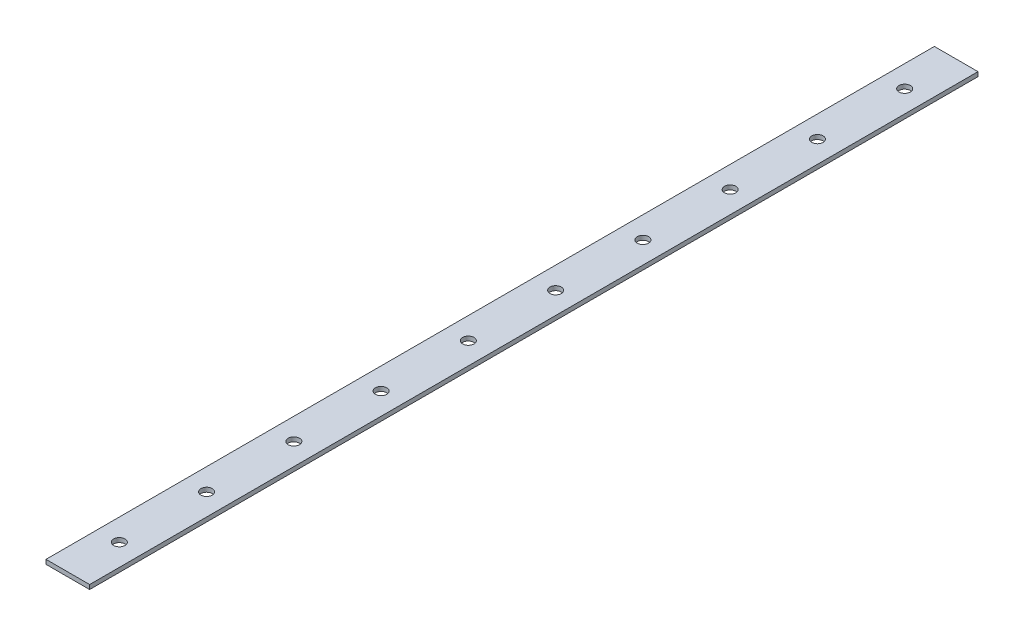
ISO-10303-21;
HEADER;
FILE_DESCRIPTION(('STEP AP214'),'2;1');
FILE_NAME('part.step','',(''),(''),'','','');
FILE_SCHEMA(('AUTOMOTIVE_DESIGN { 1 0 10303 214 1 1 1 1 }'));
ENDSEC;
DATA;
#1=APPLICATION_CONTEXT('core data for automotive mechanical design processes');
#2=APPLICATION_PROTOCOL_DEFINITION('international standard','automotive_design',2000,#1);
#3=PRODUCT_CONTEXT('',#1,'mechanical');
#4=PRODUCT('Part','Part','',(#3));
#5=PRODUCT_RELATED_PRODUCT_CATEGORY('part','',(#4));
#6=PRODUCT_DEFINITION_FORMATION('','',#4);
#7=PRODUCT_DEFINITION_CONTEXT('part definition',#1,'design');
#8=PRODUCT_DEFINITION('design','',#6,#7);
#9=PRODUCT_DEFINITION_SHAPE('','',#8);
#10=(LENGTH_UNIT() NAMED_UNIT(*) SI_UNIT(.MILLI.,.METRE.));
#11=(NAMED_UNIT(*) PLANE_ANGLE_UNIT() SI_UNIT($,.RADIAN.));
#12=(NAMED_UNIT(*) SI_UNIT($,.STERADIAN.) SOLID_ANGLE_UNIT());
#13=UNCERTAINTY_MEASURE_WITH_UNIT(LENGTH_MEASURE(1.E-05),#10,'distance_accuracy_value','');
#14=(GEOMETRIC_REPRESENTATION_CONTEXT(3) GLOBAL_UNCERTAINTY_ASSIGNED_CONTEXT((#13)) GLOBAL_UNIT_ASSIGNED_CONTEXT((#10,
#11,#12)) REPRESENTATION_CONTEXT('',''));
#15=CARTESIAN_POINT('',(0.,0.,0.));
#16=DIRECTION('',(0.,0.,1.));
#17=DIRECTION('',(1.,0.,0.));
#18=AXIS2_PLACEMENT_3D('',#15,#16,#17);
#19=CARTESIAN_POINT('',(-25.,2.5,509.));
#20=DIRECTION('',(1.,0.,0.));
#21=DIRECTION('',(0.,0.,-1.));
#22=AXIS2_PLACEMENT_3D('',#19,#20,#21);
#23=PLANE('',#22);
#24=DIRECTION('',(0.,-1.,0.));
#25=VECTOR('',#24,1.);
#26=CARTESIAN_POINT('',(-25.,2.5,-509.));
#27=LINE('',#26,#25);
#28=CARTESIAN_POINT('',(-25.,2.5,-509.));
#29=VERTEX_POINT('',#28);
#30=CARTESIAN_POINT('',(-25.,-2.5,-509.));
#31=VERTEX_POINT('',#30);
#32=EDGE_CURVE('E74',#29,#31,#27,.T.);
#33=ORIENTED_EDGE('',*,*,#32,.T.);
#34=DIRECTION('',(0.,0.,-1.));
#35=VECTOR('',#34,1.);
#36=CARTESIAN_POINT('',(-25.,-2.5,509.));
#37=LINE('',#36,#35);
#38=CARTESIAN_POINT('',(-25.,-2.5,509.));
#39=VERTEX_POINT('',#38);
#40=EDGE_CURVE('E11',#39,#31,#37,.T.);
#41=ORIENTED_EDGE('',*,*,#40,.F.);
#42=DIRECTION('',(0.,-1.,0.));
#43=VECTOR('',#42,1.);
#44=CARTESIAN_POINT('',(-25.,2.5,509.));
#45=LINE('',#44,#43);
#46=CARTESIAN_POINT('',(-25.,2.5,509.));
#47=VERTEX_POINT('',#46);
#48=EDGE_CURVE('E97',#47,#39,#45,.T.);
#49=ORIENTED_EDGE('',*,*,#48,.F.);
#50=DIRECTION('',(0.,0.,-1.));
#51=VECTOR('',#50,1.);
#52=CARTESIAN_POINT('',(-25.,2.5,509.));
#53=LINE('',#52,#51);
#54=EDGE_CURVE('E86',#47,#29,#53,.T.);
#55=ORIENTED_EDGE('',*,*,#54,.T.);
#56=EDGE_LOOP('',(#33,#41,#49,#55));
#57=FACE_BOUND('',#56,.T.);
#58=ADVANCED_FACE('F30',(#57),#23,.F.);
#59=CARTESIAN_POINT('',(-25.,-2.5,509.));
#60=DIRECTION('',(0.,1.,0.));
#61=DIRECTION('',(-1.,0.,0.));
#62=AXIS2_PLACEMENT_3D('',#59,#60,#61);
#63=PLANE('',#62);
#64=CARTESIAN_POINT('',(3.14233502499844E-12,-2.5,450.));
#65=DIRECTION('',(0.,1.,0.));
#66=DIRECTION('',(0.,0.,1.));
#67=AXIS2_PLACEMENT_3D('',#64,#65,#66);
#68=CIRCLE('',#67,6.50000000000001);
#69=CARTESIAN_POINT('',(3.14233502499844E-12,-2.5,456.5));
#70=VERTEX_POINT('',#69);
#71=EDGE_CURVE('E132',#70,#70,#68,.T.);
#72=ORIENTED_EDGE('',*,*,#71,.T.);
#73=EDGE_LOOP('',(#72));
#74=FACE_BOUND('',#73,.T.);
#75=CARTESIAN_POINT('',(2.79318668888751E-12,-2.5,350.));
#76=DIRECTION('',(0.,1.,0.));
#77=DIRECTION('',(0.,0.,1.));
#78=AXIS2_PLACEMENT_3D('',#75,#76,#77);
#79=CIRCLE('',#78,6.50000000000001);
#80=CARTESIAN_POINT('',(2.79318668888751E-12,-2.5,356.5));
#81=VERTEX_POINT('',#80);
#82=EDGE_CURVE('E136',#81,#81,#79,.T.);
#83=ORIENTED_EDGE('',*,*,#82,.T.);
#84=EDGE_LOOP('',(#83));
#85=FACE_BOUND('',#84,.T.);
#86=CARTESIAN_POINT('',(2.44403835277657E-12,-2.5,250.));
#87=DIRECTION('',(0.,1.,0.));
#88=DIRECTION('',(0.,0.,1.));
#89=AXIS2_PLACEMENT_3D('',#86,#87,#88);
#90=CIRCLE('',#89,6.50000000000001);
#91=CARTESIAN_POINT('',(2.44403835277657E-12,-2.5,256.5));
#92=VERTEX_POINT('',#91);
#93=EDGE_CURVE('E140',#92,#92,#90,.T.);
#94=ORIENTED_EDGE('',*,*,#93,.T.);
#95=EDGE_LOOP('',(#94));
#96=FACE_BOUND('',#95,.T.);
#97=CARTESIAN_POINT('',(2.09489001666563E-12,-2.5,150.));
#98=DIRECTION('',(0.,1.,0.));
#99=DIRECTION('',(0.,0.,1.));
#100=AXIS2_PLACEMENT_3D('',#97,#98,#99);
#101=CIRCLE('',#100,6.50000000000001);
#102=CARTESIAN_POINT('',(2.09489001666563E-12,-2.5,156.5));
#103=VERTEX_POINT('',#102);
#104=EDGE_CURVE('E144',#103,#103,#101,.T.);
#105=ORIENTED_EDGE('',*,*,#104,.T.);
#106=EDGE_LOOP('',(#105));
#107=FACE_BOUND('',#106,.T.);
#108=CARTESIAN_POINT('',(1.74574168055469E-12,-2.5,49.9999999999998));
#109=DIRECTION('',(0.,1.,0.));
#110=DIRECTION('',(0.,0.,1.));
#111=AXIS2_PLACEMENT_3D('',#108,#109,#110);
#112=CIRCLE('',#111,6.5);
#113=CARTESIAN_POINT('',(1.74574168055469E-12,-2.5,56.4999999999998));
#114=VERTEX_POINT('',#113);
#115=EDGE_CURVE('E148',#114,#114,#112,.T.);
#116=ORIENTED_EDGE('',*,*,#115,.T.);
#117=EDGE_LOOP('',(#116));
#118=FACE_BOUND('',#117,.T.);
#119=CARTESIAN_POINT('',(1.39659334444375E-12,-2.5,-50.0000000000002));
#120=DIRECTION('',(0.,1.,0.));
#121=DIRECTION('',(0.,0.,1.));
#122=AXIS2_PLACEMENT_3D('',#119,#120,#121);
#123=CIRCLE('',#122,6.5);
#124=CARTESIAN_POINT('',(1.39659334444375E-12,-2.5,-43.5000000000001));
#125=VERTEX_POINT('',#124);
#126=EDGE_CURVE('E152',#125,#125,#123,.T.);
#127=ORIENTED_EDGE('',*,*,#126,.T.);
#128=EDGE_LOOP('',(#127));
#129=FACE_BOUND('',#128,.T.);
#130=CARTESIAN_POINT('',(1.04744500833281E-12,-2.5,-150.));
#131=DIRECTION('',(0.,1.,0.));
#132=DIRECTION('',(0.,0.,1.));
#133=AXIS2_PLACEMENT_3D('',#130,#131,#132);
#134=CIRCLE('',#133,6.50000000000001);
#135=CARTESIAN_POINT('',(1.04744500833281E-12,-2.5,-143.5));
#136=VERTEX_POINT('',#135);
#137=EDGE_CURVE('E156',#136,#136,#134,.T.);
#138=ORIENTED_EDGE('',*,*,#137,.T.);
#139=EDGE_LOOP('',(#138));
#140=FACE_BOUND('',#139,.T.);
#141=CARTESIAN_POINT('',(6.98296672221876E-13,-2.5,-250.));
#142=DIRECTION('',(0.,1.,0.));
#143=DIRECTION('',(0.,0.,1.));
#144=AXIS2_PLACEMENT_3D('',#141,#142,#143);
#145=CIRCLE('',#144,6.50000000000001);
#146=CARTESIAN_POINT('',(6.98296672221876E-13,-2.5,-243.5));
#147=VERTEX_POINT('',#146);
#148=EDGE_CURVE('E160',#147,#147,#145,.T.);
#149=ORIENTED_EDGE('',*,*,#148,.T.);
#150=EDGE_LOOP('',(#149));
#151=FACE_BOUND('',#150,.T.);
#152=CARTESIAN_POINT('',(3.49148336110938E-13,-2.5,-350.));
#153=DIRECTION('',(0.,1.,0.));
#154=DIRECTION('',(0.,0.,1.));
#155=AXIS2_PLACEMENT_3D('',#152,#153,#154);
#156=CIRCLE('',#155,6.50000000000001);
#157=CARTESIAN_POINT('',(3.49148336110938E-13,-2.5,-343.5));
#158=VERTEX_POINT('',#157);
#159=EDGE_CURVE('E164',#158,#158,#156,.T.);
#160=ORIENTED_EDGE('',*,*,#159,.T.);
#161=EDGE_LOOP('',(#160));
#162=FACE_BOUND('',#161,.T.);
#163=CARTESIAN_POINT('',(0.,-2.5,-450.));
#164=DIRECTION('',(0.,1.,0.));
#165=DIRECTION('',(0.,0.,1.));
#166=AXIS2_PLACEMENT_3D('',#163,#164,#165);
#167=CIRCLE('',#166,6.50000000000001);
#168=CARTESIAN_POINT('',(0.,-2.5,-443.5));
#169=VERTEX_POINT('',#168);
#170=EDGE_CURVE('E87',#169,#169,#167,.T.);
#171=ORIENTED_EDGE('',*,*,#170,.T.);
#172=EDGE_LOOP('',(#171));
#173=FACE_BOUND('',#172,.T.);
#174=DIRECTION('',(1.,0.,0.));
#175=VECTOR('',#174,1.);
#176=CARTESIAN_POINT('',(-25.,-2.5,-509.));
#177=LINE('',#176,#175);
#178=CARTESIAN_POINT('',(25.,-2.5,-509.));
#179=VERTEX_POINT('',#178);
#180=EDGE_CURVE('E70',#31,#179,#177,.T.);
#181=ORIENTED_EDGE('',*,*,#180,.T.);
#182=DIRECTION('',(0.,0.,-1.));
#183=VECTOR('',#182,1.);
#184=CARTESIAN_POINT('',(25.,-2.5,509.));
#185=LINE('',#184,#183);
#186=CARTESIAN_POINT('',(25.,-2.5,509.));
#187=VERTEX_POINT('',#186);
#188=EDGE_CURVE('E37',#187,#179,#185,.T.);
#189=ORIENTED_EDGE('',*,*,#188,.F.);
#190=DIRECTION('',(1.,0.,0.));
#191=VECTOR('',#190,1.);
#192=CARTESIAN_POINT('',(-25.,-2.5,509.));
#193=LINE('',#192,#191);
#194=EDGE_CURVE('E82',#39,#187,#193,.T.);
#195=ORIENTED_EDGE('',*,*,#194,.F.);
#196=ORIENTED_EDGE('',*,*,#40,.T.);
#197=EDGE_LOOP('',(#181,#189,#195,#196));
#198=FACE_BOUND('',#197,.T.);
#199=ADVANCED_FACE('F81',(#74,#85,#96,#107,#118,#129,#140,#151,#162,#173,#198),#63,.F.);
#200=CARTESIAN_POINT('',(25.,2.5,509.));
#201=DIRECTION('',(-1.,0.,0.));
#202=DIRECTION('',(0.,-1.,0.));
#203=AXIS2_PLACEMENT_3D('',#200,#201,#202);
#204=PLANE('',#203);
#205=DIRECTION('',(0.,1.,0.));
#206=VECTOR('',#205,1.);
#207=CARTESIAN_POINT('',(25.,2.5,-509.));
#208=LINE('',#207,#206);
#209=CARTESIAN_POINT('',(25.,2.5,-509.));
#210=VERTEX_POINT('',#209);
#211=EDGE_CURVE('E75',#179,#210,#208,.T.);
#212=ORIENTED_EDGE('',*,*,#211,.T.);
#213=DIRECTION('',(0.,0.,-1.));
#214=VECTOR('',#213,1.);
#215=CARTESIAN_POINT('',(25.,2.5,509.));
#216=LINE('',#215,#214);
#217=CARTESIAN_POINT('',(25.,2.5,509.));
#218=VERTEX_POINT('',#217);
#219=EDGE_CURVE('E103',#218,#210,#216,.T.);
#220=ORIENTED_EDGE('',*,*,#219,.F.);
#221=DIRECTION('',(0.,1.,0.));
#222=VECTOR('',#221,1.);
#223=CARTESIAN_POINT('',(25.,2.5,509.));
#224=LINE('',#223,#222);
#225=EDGE_CURVE('E49',#187,#218,#224,.T.);
#226=ORIENTED_EDGE('',*,*,#225,.F.);
#227=ORIENTED_EDGE('',*,*,#188,.T.);
#228=EDGE_LOOP('',(#212,#220,#226,#227));
#229=FACE_BOUND('',#228,.T.);
#230=ADVANCED_FACE('F106',(#229),#204,.F.);
#231=CARTESIAN_POINT('',(-25.,2.5,509.));
#232=DIRECTION('',(0.,-1.,0.));
#233=DIRECTION('',(0.,0.,-1.));
#234=AXIS2_PLACEMENT_3D('',#231,#232,#233);
#235=PLANE('',#234);
#236=CARTESIAN_POINT('',(3.14233502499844E-12,2.5,450.));
#237=DIRECTION('',(0.,1.,0.));
#238=DIRECTION('',(0.,0.,1.));
#239=AXIS2_PLACEMENT_3D('',#236,#237,#238);
#240=CIRCLE('',#239,6.50000000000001);
#241=CARTESIAN_POINT('',(3.14233502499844E-12,2.5,456.5));
#242=VERTEX_POINT('',#241);
#243=EDGE_CURVE('E208',#242,#242,#240,.T.);
#244=ORIENTED_EDGE('',*,*,#243,.F.);
#245=EDGE_LOOP('',(#244));
#246=FACE_BOUND('',#245,.T.);
#247=CARTESIAN_POINT('',(2.79318668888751E-12,2.5,350.));
#248=DIRECTION('',(0.,1.,0.));
#249=DIRECTION('',(0.,0.,1.));
#250=AXIS2_PLACEMENT_3D('',#247,#248,#249);
#251=CIRCLE('',#250,6.50000000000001);
#252=CARTESIAN_POINT('',(2.79318668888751E-12,2.5,356.5));
#253=VERTEX_POINT('',#252);
#254=EDGE_CURVE('E204',#253,#253,#251,.T.);
#255=ORIENTED_EDGE('',*,*,#254,.F.);
#256=EDGE_LOOP('',(#255));
#257=FACE_BOUND('',#256,.T.);
#258=CARTESIAN_POINT('',(2.44403835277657E-12,2.5,250.));
#259=DIRECTION('',(0.,1.,0.));
#260=DIRECTION('',(0.,0.,1.));
#261=AXIS2_PLACEMENT_3D('',#258,#259,#260);
#262=CIRCLE('',#261,6.50000000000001);
#263=CARTESIAN_POINT('',(2.44403835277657E-12,2.5,256.5));
#264=VERTEX_POINT('',#263);
#265=EDGE_CURVE('E200',#264,#264,#262,.T.);
#266=ORIENTED_EDGE('',*,*,#265,.F.);
#267=EDGE_LOOP('',(#266));
#268=FACE_BOUND('',#267,.T.);
#269=CARTESIAN_POINT('',(2.09489001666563E-12,2.5,150.));
#270=DIRECTION('',(0.,1.,0.));
#271=DIRECTION('',(0.,0.,1.));
#272=AXIS2_PLACEMENT_3D('',#269,#270,#271);
#273=CIRCLE('',#272,6.50000000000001);
#274=CARTESIAN_POINT('',(2.09489001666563E-12,2.5,156.5));
#275=VERTEX_POINT('',#274);
#276=EDGE_CURVE('E196',#275,#275,#273,.T.);
#277=ORIENTED_EDGE('',*,*,#276,.F.);
#278=EDGE_LOOP('',(#277));
#279=FACE_BOUND('',#278,.T.);
#280=CARTESIAN_POINT('',(1.74574168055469E-12,2.5,49.9999999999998));
#281=DIRECTION('',(0.,1.,0.));
#282=DIRECTION('',(0.,0.,1.));
#283=AXIS2_PLACEMENT_3D('',#280,#281,#282);
#284=CIRCLE('',#283,6.5);
#285=CARTESIAN_POINT('',(1.74574168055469E-12,2.5,56.4999999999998));
#286=VERTEX_POINT('',#285);
#287=EDGE_CURVE('E192',#286,#286,#284,.T.);
#288=ORIENTED_EDGE('',*,*,#287,.F.);
#289=EDGE_LOOP('',(#288));
#290=FACE_BOUND('',#289,.T.);
#291=CARTESIAN_POINT('',(1.39659334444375E-12,2.5,-50.0000000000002));
#292=DIRECTION('',(0.,1.,0.));
#293=DIRECTION('',(0.,0.,1.));
#294=AXIS2_PLACEMENT_3D('',#291,#292,#293);
#295=CIRCLE('',#294,6.5);
#296=CARTESIAN_POINT('',(1.39659334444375E-12,2.5,-43.5000000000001));
#297=VERTEX_POINT('',#296);
#298=EDGE_CURVE('E188',#297,#297,#295,.T.);
#299=ORIENTED_EDGE('',*,*,#298,.F.);
#300=EDGE_LOOP('',(#299));
#301=FACE_BOUND('',#300,.T.);
#302=CARTESIAN_POINT('',(1.04744500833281E-12,2.5,-150.));
#303=DIRECTION('',(0.,1.,0.));
#304=DIRECTION('',(0.,0.,1.));
#305=AXIS2_PLACEMENT_3D('',#302,#303,#304);
#306=CIRCLE('',#305,6.50000000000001);
#307=CARTESIAN_POINT('',(1.04744500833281E-12,2.5,-143.5));
#308=VERTEX_POINT('',#307);
#309=EDGE_CURVE('E184',#308,#308,#306,.T.);
#310=ORIENTED_EDGE('',*,*,#309,.F.);
#311=EDGE_LOOP('',(#310));
#312=FACE_BOUND('',#311,.T.);
#313=CARTESIAN_POINT('',(6.98296672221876E-13,2.5,-250.));
#314=DIRECTION('',(0.,1.,0.));
#315=DIRECTION('',(0.,0.,1.));
#316=AXIS2_PLACEMENT_3D('',#313,#314,#315);
#317=CIRCLE('',#316,6.50000000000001);
#318=CARTESIAN_POINT('',(6.98296672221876E-13,2.5,-243.5));
#319=VERTEX_POINT('',#318);
#320=EDGE_CURVE('E180',#319,#319,#317,.T.);
#321=ORIENTED_EDGE('',*,*,#320,.F.);
#322=EDGE_LOOP('',(#321));
#323=FACE_BOUND('',#322,.T.);
#324=CARTESIAN_POINT('',(3.49148336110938E-13,2.5,-350.));
#325=DIRECTION('',(0.,1.,0.));
#326=DIRECTION('',(0.,0.,1.));
#327=AXIS2_PLACEMENT_3D('',#324,#325,#326);
#328=CIRCLE('',#327,6.50000000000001);
#329=CARTESIAN_POINT('',(3.49148336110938E-13,2.5,-343.5));
#330=VERTEX_POINT('',#329);
#331=EDGE_CURVE('E174',#330,#330,#328,.T.);
#332=ORIENTED_EDGE('',*,*,#331,.F.);
#333=EDGE_LOOP('',(#332));
#334=FACE_BOUND('',#333,.T.);
#335=CARTESIAN_POINT('',(0.,2.5,-450.));
#336=DIRECTION('',(0.,1.,0.));
#337=DIRECTION('',(0.,0.,1.));
#338=AXIS2_PLACEMENT_3D('',#335,#336,#337);
#339=CIRCLE('',#338,6.50000000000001);
#340=CARTESIAN_POINT('',(0.,2.5,-443.5));
#341=VERTEX_POINT('',#340);
#342=EDGE_CURVE('E90',#341,#341,#339,.T.);
#343=ORIENTED_EDGE('',*,*,#342,.F.);
#344=EDGE_LOOP('',(#343));
#345=FACE_BOUND('',#344,.T.);
#346=DIRECTION('',(-1.,0.,0.));
#347=VECTOR('',#346,1.);
#348=CARTESIAN_POINT('',(-25.,2.5,-509.));
#349=LINE('',#348,#347);
#350=EDGE_CURVE('E95',#210,#29,#349,.T.);
#351=ORIENTED_EDGE('',*,*,#350,.T.);
#352=ORIENTED_EDGE('',*,*,#54,.F.);
#353=DIRECTION('',(-1.,0.,0.));
#354=VECTOR('',#353,1.);
#355=CARTESIAN_POINT('',(-25.,2.5,509.));
#356=LINE('',#355,#354);
#357=EDGE_CURVE('E44',#218,#47,#356,.T.);
#358=ORIENTED_EDGE('',*,*,#357,.F.);
#359=ORIENTED_EDGE('',*,*,#219,.T.);
#360=EDGE_LOOP('',(#351,#352,#358,#359));
#361=FACE_BOUND('',#360,.T.);
#362=ADVANCED_FACE('F108',(#246,#257,#268,#279,#290,#301,#312,#323,#334,#345,#361),#235,.F.);
#363=CARTESIAN_POINT('',(-25.,2.5,509.));
#364=DIRECTION('',(0.,0.,1.));
#365=DIRECTION('',(1.,0.,0.));
#366=AXIS2_PLACEMENT_3D('',#363,#364,#365);
#367=PLANE('',#366);
#368=ORIENTED_EDGE('',*,*,#48,.T.);
#369=ORIENTED_EDGE('',*,*,#194,.T.);
#370=ORIENTED_EDGE('',*,*,#225,.T.);
#371=ORIENTED_EDGE('',*,*,#357,.T.);
#372=EDGE_LOOP('',(#368,#369,#370,#371));
#373=FACE_BOUND('',#372,.T.);
#374=ADVANCED_FACE('F109',(#373),#367,.T.);
#375=CARTESIAN_POINT('',(-25.,2.5,-509.));
#376=DIRECTION('',(0.,0.,1.));
#377=DIRECTION('',(1.,0.,0.));
#378=AXIS2_PLACEMENT_3D('',#375,#376,#377);
#379=PLANE('',#378);
#380=ORIENTED_EDGE('',*,*,#32,.F.);
#381=ORIENTED_EDGE('',*,*,#350,.F.);
#382=ORIENTED_EDGE('',*,*,#211,.F.);
#383=ORIENTED_EDGE('',*,*,#180,.F.);
#384=EDGE_LOOP('',(#380,#381,#382,#383));
#385=FACE_BOUND('',#384,.T.);
#386=ADVANCED_FACE('F71',(#385),#379,.F.);
#387=CARTESIAN_POINT('',(0.,-2.5,-450.));
#388=DIRECTION('',(0.,1.,0.));
#389=DIRECTION('',(0.,0.,1.));
#390=AXIS2_PLACEMENT_3D('',#387,#388,#389);
#391=CYLINDRICAL_SURFACE('',#390,6.50000000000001);
#392=ORIENTED_EDGE('',*,*,#170,.F.);
#393=EDGE_LOOP('',(#392));
#394=FACE_BOUND('',#393,.T.);
#395=ORIENTED_EDGE('',*,*,#342,.T.);
#396=EDGE_LOOP('',(#395));
#397=FACE_BOUND('',#396,.T.);
#398=ADVANCED_FACE('F116',(#394,#397),#391,.F.);
#399=CARTESIAN_POINT('',(3.49148336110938E-13,-2.5,-350.));
#400=DIRECTION('',(0.,1.,0.));
#401=DIRECTION('',(0.,0.,1.));
#402=AXIS2_PLACEMENT_3D('',#399,#400,#401);
#403=CYLINDRICAL_SURFACE('',#402,6.50000000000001);
#404=ORIENTED_EDGE('',*,*,#159,.F.);
#405=EDGE_LOOP('',(#404));
#406=FACE_BOUND('',#405,.T.);
#407=ORIENTED_EDGE('',*,*,#331,.T.);
#408=EDGE_LOOP('',(#407));
#409=FACE_BOUND('',#408,.T.);
#410=ADVANCED_FACE('F169',(#406,#409),#403,.F.);
#411=CARTESIAN_POINT('',(6.98296672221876E-13,-2.5,-250.));
#412=DIRECTION('',(0.,1.,0.));
#413=DIRECTION('',(0.,0.,1.));
#414=AXIS2_PLACEMENT_3D('',#411,#412,#413);
#415=CYLINDRICAL_SURFACE('',#414,6.50000000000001);
#416=ORIENTED_EDGE('',*,*,#148,.F.);
#417=EDGE_LOOP('',(#416));
#418=FACE_BOUND('',#417,.T.);
#419=ORIENTED_EDGE('',*,*,#320,.T.);
#420=EDGE_LOOP('',(#419));
#421=FACE_BOUND('',#420,.T.);
#422=ADVANCED_FACE('F231',(#418,#421),#415,.F.);
#423=CARTESIAN_POINT('',(1.04744500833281E-12,-2.5,-150.));
#424=DIRECTION('',(0.,1.,0.));
#425=DIRECTION('',(0.,0.,1.));
#426=AXIS2_PLACEMENT_3D('',#423,#424,#425);
#427=CYLINDRICAL_SURFACE('',#426,6.50000000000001);
#428=ORIENTED_EDGE('',*,*,#137,.F.);
#429=EDGE_LOOP('',(#428));
#430=FACE_BOUND('',#429,.T.);
#431=ORIENTED_EDGE('',*,*,#309,.T.);
#432=EDGE_LOOP('',(#431));
#433=FACE_BOUND('',#432,.T.);
#434=ADVANCED_FACE('F237',(#430,#433),#427,.F.);
#435=CARTESIAN_POINT('',(1.39659334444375E-12,-2.5,-50.0000000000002));
#436=DIRECTION('',(0.,1.,0.));
#437=DIRECTION('',(0.,0.,1.));
#438=AXIS2_PLACEMENT_3D('',#435,#436,#437);
#439=CYLINDRICAL_SURFACE('',#438,6.5);
#440=ORIENTED_EDGE('',*,*,#126,.F.);
#441=EDGE_LOOP('',(#440));
#442=FACE_BOUND('',#441,.T.);
#443=ORIENTED_EDGE('',*,*,#298,.T.);
#444=EDGE_LOOP('',(#443));
#445=FACE_BOUND('',#444,.T.);
#446=ADVANCED_FACE('F243',(#442,#445),#439,.F.);
#447=CARTESIAN_POINT('',(1.74574168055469E-12,-2.5,49.9999999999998));
#448=DIRECTION('',(0.,1.,0.));
#449=DIRECTION('',(0.,0.,1.));
#450=AXIS2_PLACEMENT_3D('',#447,#448,#449);
#451=CYLINDRICAL_SURFACE('',#450,6.5);
#452=ORIENTED_EDGE('',*,*,#115,.F.);
#453=EDGE_LOOP('',(#452));
#454=FACE_BOUND('',#453,.T.);
#455=ORIENTED_EDGE('',*,*,#287,.T.);
#456=EDGE_LOOP('',(#455));
#457=FACE_BOUND('',#456,.T.);
#458=ADVANCED_FACE('F247',(#454,#457),#451,.F.);
#459=CARTESIAN_POINT('',(2.09489001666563E-12,-2.5,150.));
#460=DIRECTION('',(0.,1.,0.));
#461=DIRECTION('',(0.,0.,1.));
#462=AXIS2_PLACEMENT_3D('',#459,#460,#461);
#463=CYLINDRICAL_SURFACE('',#462,6.50000000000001);
#464=ORIENTED_EDGE('',*,*,#104,.F.);
#465=EDGE_LOOP('',(#464));
#466=FACE_BOUND('',#465,.T.);
#467=ORIENTED_EDGE('',*,*,#276,.T.);
#468=EDGE_LOOP('',(#467));
#469=FACE_BOUND('',#468,.T.);
#470=ADVANCED_FACE('F251',(#466,#469),#463,.F.);
#471=CARTESIAN_POINT('',(2.44403835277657E-12,-2.5,250.));
#472=DIRECTION('',(0.,1.,0.));
#473=DIRECTION('',(0.,0.,1.));
#474=AXIS2_PLACEMENT_3D('',#471,#472,#473);
#475=CYLINDRICAL_SURFACE('',#474,6.50000000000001);
#476=ORIENTED_EDGE('',*,*,#93,.F.);
#477=EDGE_LOOP('',(#476));
#478=FACE_BOUND('',#477,.T.);
#479=ORIENTED_EDGE('',*,*,#265,.T.);
#480=EDGE_LOOP('',(#479));
#481=FACE_BOUND('',#480,.T.);
#482=ADVANCED_FACE('F255',(#478,#481),#475,.F.);
#483=CARTESIAN_POINT('',(2.79318668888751E-12,-2.5,350.));
#484=DIRECTION('',(0.,1.,0.));
#485=DIRECTION('',(0.,0.,1.));
#486=AXIS2_PLACEMENT_3D('',#483,#484,#485);
#487=CYLINDRICAL_SURFACE('',#486,6.50000000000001);
#488=ORIENTED_EDGE('',*,*,#82,.F.);
#489=EDGE_LOOP('',(#488));
#490=FACE_BOUND('',#489,.T.);
#491=ORIENTED_EDGE('',*,*,#254,.T.);
#492=EDGE_LOOP('',(#491));
#493=FACE_BOUND('',#492,.T.);
#494=ADVANCED_FACE('F259',(#490,#493),#487,.F.);
#495=CARTESIAN_POINT('',(3.14233502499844E-12,-2.5,450.));
#496=DIRECTION('',(0.,1.,0.));
#497=DIRECTION('',(0.,0.,1.));
#498=AXIS2_PLACEMENT_3D('',#495,#496,#497);
#499=CYLINDRICAL_SURFACE('',#498,6.50000000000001);
#500=ORIENTED_EDGE('',*,*,#71,.F.);
#501=EDGE_LOOP('',(#500));
#502=FACE_BOUND('',#501,.T.);
#503=ORIENTED_EDGE('',*,*,#243,.T.);
#504=EDGE_LOOP('',(#503));
#505=FACE_BOUND('',#504,.T.);
#506=ADVANCED_FACE('F212',(#502,#505),#499,.F.);
#507=CLOSED_SHELL('',(#58,#199,#230,#362,#374,#386,#398,#410,#422,#434,#446,#458,#470,#482,#494,#506));
#508=MANIFOLD_SOLID_BREP('B2',#507);
#509=ADVANCED_BREP_SHAPE_REPRESENTATION('',(#18,#508),#14);
#510=SHAPE_DEFINITION_REPRESENTATION(#9,#509);
ENDSEC;
END-ISO-10303-21;
